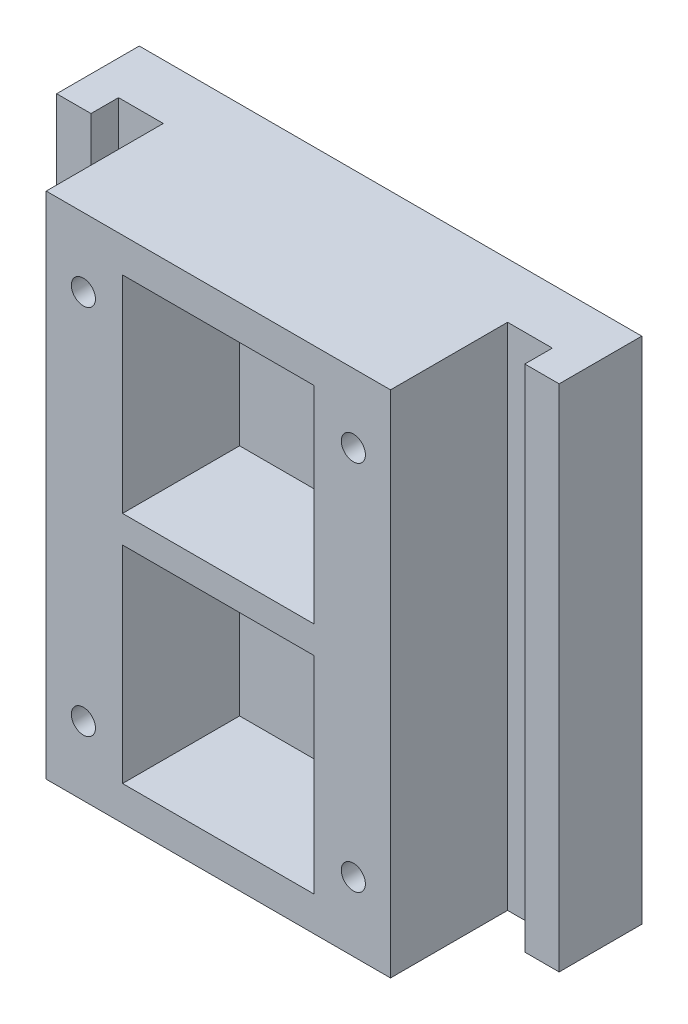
ISO-10303-21;
HEADER;
FILE_DESCRIPTION(('STEP AP214'),'2;1');
FILE_NAME('part.step','',(''),(''),'','','');
FILE_SCHEMA(('AUTOMOTIVE_DESIGN { 1 0 10303 214 1 1 1 1 }'));
ENDSEC;
DATA;
#1=APPLICATION_CONTEXT('core data for automotive mechanical design processes');
#2=APPLICATION_PROTOCOL_DEFINITION('international standard','automotive_design',2000,#1);
#3=PRODUCT_CONTEXT('',#1,'mechanical');
#4=PRODUCT('Part','Part','',(#3));
#5=PRODUCT_RELATED_PRODUCT_CATEGORY('part','',(#4));
#6=PRODUCT_DEFINITION_FORMATION('','',#4);
#7=PRODUCT_DEFINITION_CONTEXT('part definition',#1,'design');
#8=PRODUCT_DEFINITION('design','',#6,#7);
#9=PRODUCT_DEFINITION_SHAPE('','',#8);
#10=(LENGTH_UNIT() NAMED_UNIT(*) SI_UNIT(.MILLI.,.METRE.));
#11=(NAMED_UNIT(*) PLANE_ANGLE_UNIT() SI_UNIT($,.RADIAN.));
#12=(NAMED_UNIT(*) SI_UNIT($,.STERADIAN.) SOLID_ANGLE_UNIT());
#13=UNCERTAINTY_MEASURE_WITH_UNIT(LENGTH_MEASURE(1.E-05),#10,'distance_accuracy_value','');
#14=(GEOMETRIC_REPRESENTATION_CONTEXT(3) GLOBAL_UNCERTAINTY_ASSIGNED_CONTEXT((#13)) GLOBAL_UNIT_ASSIGNED_CONTEXT((#10,
#11,#12)) REPRESENTATION_CONTEXT('',''));
#15=CARTESIAN_POINT('',(0.,0.,0.));
#16=DIRECTION('',(0.,0.,1.));
#17=DIRECTION('',(1.,0.,0.));
#18=AXIS2_PLACEMENT_3D('',#15,#16,#17);
#19=CARTESIAN_POINT('',(0.,0.,8.));
#20=DIRECTION('',(0.,0.,1.));
#21=DIRECTION('',(1.,0.,0.));
#22=AXIS2_PLACEMENT_3D('',#19,#20,#21);
#23=PLANE('',#22);
#24=DIRECTION('',(0.,1.,0.));
#25=VECTOR('',#24,1.);
#26=CARTESIAN_POINT('',(88.5703211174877,0.,8.));
#27=LINE('',#26,#25);
#28=CARTESIAN_POINT('',(88.5703211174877,5.00000000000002,8.));
#29=VERTEX_POINT('',#28);
#30=CARTESIAN_POINT('',(88.5703211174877,35.,8.));
#31=VERTEX_POINT('',#30);
#32=EDGE_CURVE('E323',#29,#31,#27,.T.);
#33=ORIENTED_EDGE('',*,*,#32,.T.);
#34=DIRECTION('',(1.,0.,0.));
#35=VECTOR('',#34,1.);
#36=CARTESIAN_POINT('',(60.7296788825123,35.,8.));
#37=LINE('',#36,#35);
#38=CARTESIAN_POINT('',(60.7296788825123,35.,8.));
#39=VERTEX_POINT('',#38);
#40=EDGE_CURVE('E204',#39,#31,#37,.T.);
#41=ORIENTED_EDGE('',*,*,#40,.F.);
#42=DIRECTION('',(0.,1.,0.));
#43=VECTOR('',#42,1.);
#44=CARTESIAN_POINT('',(60.7296788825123,0.,8.));
#45=LINE('',#44,#43);
#46=CARTESIAN_POINT('',(60.7296788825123,5.00000000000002,8.));
#47=VERTEX_POINT('',#46);
#48=EDGE_CURVE('E193',#47,#39,#45,.T.);
#49=ORIENTED_EDGE('',*,*,#48,.F.);
#50=DIRECTION('',(-1.,0.,0.));
#51=VECTOR('',#50,1.);
#52=CARTESIAN_POINT('',(0.,5.00000000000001,8.));
#53=LINE('',#52,#51);
#54=EDGE_CURVE('E320',#29,#47,#53,.T.);
#55=ORIENTED_EDGE('',*,*,#54,.F.);
#56=EDGE_LOOP('',(#33,#41,#49,#55));
#57=FACE_BOUND('',#56,.T.);
#58=ADVANCED_FACE('F33',(#57),#23,.T.);
#59=CARTESIAN_POINT('',(60.7296788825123,38.97,8.));
#60=VERTEX_POINT('',#59);
#61=CARTESIAN_POINT('',(60.7296788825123,68.97,8.));
#62=VERTEX_POINT('',#61);
#63=EDGE_CURVE('E318',#60,#62,#45,.T.);
#64=ORIENTED_EDGE('',*,*,#63,.F.);
#65=DIRECTION('',(-1.,0.,0.));
#66=VECTOR('',#65,1.);
#67=CARTESIAN_POINT('',(60.7296788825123,38.97,8.));
#68=LINE('',#67,#66);
#69=CARTESIAN_POINT('',(88.5703211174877,38.97,8.));
#70=VERTEX_POINT('',#69);
#71=EDGE_CURVE('E50',#70,#60,#68,.T.);
#72=ORIENTED_EDGE('',*,*,#71,.F.);
#73=CARTESIAN_POINT('',(88.5703211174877,68.97,8.));
#74=VERTEX_POINT('',#73);
#75=EDGE_CURVE('E322',#70,#74,#27,.T.);
#76=ORIENTED_EDGE('',*,*,#75,.T.);
#77=DIRECTION('',(-1.,0.,0.));
#78=VECTOR('',#77,1.);
#79=CARTESIAN_POINT('',(0.,68.97,8.));
#80=LINE('',#79,#78);
#81=EDGE_CURVE('E325',#74,#62,#80,.T.);
#82=ORIENTED_EDGE('',*,*,#81,.T.);
#83=EDGE_LOOP('',(#64,#72,#76,#82));
#84=FACE_BOUND('',#83,.T.);
#85=ADVANCED_FACE('F452',(#84),#23,.T.);
#86=CARTESIAN_POINT('',(88.5703211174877,0.,8.));
#87=DIRECTION('',(1.,0.,0.));
#88=DIRECTION('',(0.,0.,-1.));
#89=AXIS2_PLACEMENT_3D('',#86,#87,#88);
#90=PLANE('',#89);
#91=DIRECTION('',(0.,0.,-1.));
#92=VECTOR('',#91,1.);
#93=CARTESIAN_POINT('',(88.5703211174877,35.,25.));
#94=LINE('',#93,#92);
#95=CARTESIAN_POINT('',(88.5703211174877,35.,25.));
#96=VERTEX_POINT('',#95);
#97=EDGE_CURVE('E58',#96,#31,#94,.T.);
#98=ORIENTED_EDGE('',*,*,#97,.T.);
#99=ORIENTED_EDGE('',*,*,#32,.F.);
#100=DIRECTION('',(0.,0.,1.));
#101=VECTOR('',#100,1.);
#102=CARTESIAN_POINT('',(88.5703211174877,5.00000000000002,8.));
#103=LINE('',#102,#101);
#104=CARTESIAN_POINT('',(88.5703211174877,5.00000000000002,25.));
#105=VERTEX_POINT('',#104);
#106=EDGE_CURVE('E335',#29,#105,#103,.T.);
#107=ORIENTED_EDGE('',*,*,#106,.T.);
#108=DIRECTION('',(0.,1.,0.));
#109=VECTOR('',#108,1.);
#110=CARTESIAN_POINT('',(88.5703211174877,5.00000000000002,25.));
#111=LINE('',#110,#109);
#112=EDGE_CURVE('E252',#105,#96,#111,.T.);
#113=ORIENTED_EDGE('',*,*,#112,.T.);
#114=EDGE_LOOP('',(#98,#99,#107,#113));
#115=FACE_BOUND('',#114,.T.);
#116=ADVANCED_FACE('F458',(#115),#90,.F.);
#117=DIRECTION('',(0.,0.,-1.));
#118=VECTOR('',#117,1.);
#119=CARTESIAN_POINT('',(88.5703211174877,38.97,25.));
#120=LINE('',#119,#118);
#121=CARTESIAN_POINT('',(88.5703211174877,38.97,25.));
#122=VERTEX_POINT('',#121);
#123=EDGE_CURVE('E209',#122,#70,#120,.T.);
#124=ORIENTED_EDGE('',*,*,#123,.F.);
#125=CARTESIAN_POINT('',(88.5703211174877,68.97,25.));
#126=VERTEX_POINT('',#125);
#127=EDGE_CURVE('E249',#122,#126,#111,.T.);
#128=ORIENTED_EDGE('',*,*,#127,.T.);
#129=DIRECTION('',(0.,0.,1.));
#130=VECTOR('',#129,1.);
#131=CARTESIAN_POINT('',(88.5703211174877,68.97,8.));
#132=LINE('',#131,#130);
#133=EDGE_CURVE('E332',#74,#126,#132,.T.);
#134=ORIENTED_EDGE('',*,*,#133,.F.);
#135=ORIENTED_EDGE('',*,*,#75,.F.);
#136=EDGE_LOOP('',(#124,#128,#134,#135));
#137=FACE_BOUND('',#136,.T.);
#138=ADVANCED_FACE('F470',(#137),#90,.F.);
#139=CARTESIAN_POINT('',(60.7296788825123,0.,8.));
#140=DIRECTION('',(1.,0.,0.));
#141=DIRECTION('',(0.,0.,-1.));
#142=AXIS2_PLACEMENT_3D('',#139,#140,#141);
#143=PLANE('',#142);
#144=ORIENTED_EDGE('',*,*,#48,.T.);
#145=DIRECTION('',(0.,0.,-1.));
#146=VECTOR('',#145,1.);
#147=CARTESIAN_POINT('',(60.7296788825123,35.,25.));
#148=LINE('',#147,#146);
#149=CARTESIAN_POINT('',(60.7296788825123,35.,25.));
#150=VERTEX_POINT('',#149);
#151=EDGE_CURVE('E190',#150,#39,#148,.T.);
#152=ORIENTED_EDGE('',*,*,#151,.F.);
#153=DIRECTION('',(0.,-1.,0.));
#154=VECTOR('',#153,1.);
#155=CARTESIAN_POINT('',(60.7296788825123,5.00000000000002,25.));
#156=LINE('',#155,#154);
#157=CARTESIAN_POINT('',(60.7296788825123,5.00000000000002,25.));
#158=VERTEX_POINT('',#157);
#159=EDGE_CURVE('E173',#150,#158,#156,.T.);
#160=ORIENTED_EDGE('',*,*,#159,.T.);
#161=DIRECTION('',(0.,0.,1.));
#162=VECTOR('',#161,1.);
#163=CARTESIAN_POINT('',(60.7296788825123,5.00000000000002,8.));
#164=LINE('',#163,#162);
#165=EDGE_CURVE('E328',#47,#158,#164,.T.);
#166=ORIENTED_EDGE('',*,*,#165,.F.);
#167=EDGE_LOOP('',(#144,#152,#160,#166));
#168=FACE_BOUND('',#167,.T.);
#169=ADVANCED_FACE('F191',(#168),#143,.T.);
#170=CARTESIAN_POINT('',(60.7296788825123,68.97,25.));
#171=VERTEX_POINT('',#170);
#172=CARTESIAN_POINT('',(60.7296788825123,38.97,25.));
#173=VERTEX_POINT('',#172);
#174=EDGE_CURVE('E185',#171,#173,#156,.T.);
#175=ORIENTED_EDGE('',*,*,#174,.T.);
#176=DIRECTION('',(0.,0.,-1.));
#177=VECTOR('',#176,1.);
#178=CARTESIAN_POINT('',(60.7296788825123,38.97,25.));
#179=LINE('',#178,#177);
#180=EDGE_CURVE('E202',#173,#60,#179,.T.);
#181=ORIENTED_EDGE('',*,*,#180,.T.);
#182=ORIENTED_EDGE('',*,*,#63,.T.);
#183=DIRECTION('',(0.,0.,1.));
#184=VECTOR('',#183,1.);
#185=CARTESIAN_POINT('',(60.7296788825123,68.97,8.));
#186=LINE('',#185,#184);
#187=EDGE_CURVE('E329',#62,#171,#186,.T.);
#188=ORIENTED_EDGE('',*,*,#187,.T.);
#189=EDGE_LOOP('',(#175,#181,#182,#188));
#190=FACE_BOUND('',#189,.T.);
#191=ADVANCED_FACE('F382',(#190),#143,.T.);
#192=CARTESIAN_POINT('',(0.,0.,25.));
#193=DIRECTION('',(0.,0.,1.));
#194=DIRECTION('',(1.,0.,0.));
#195=AXIS2_PLACEMENT_3D('',#192,#193,#194);
#196=PLANE('',#195);
#197=ORIENTED_EDGE('',*,*,#127,.F.);
#198=DIRECTION('',(-1.,0.,0.));
#199=VECTOR('',#198,1.);
#200=CARTESIAN_POINT('',(60.7296788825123,38.97,25.));
#201=LINE('',#200,#199);
#202=EDGE_CURVE('E199',#122,#173,#201,.T.);
#203=ORIENTED_EDGE('',*,*,#202,.T.);
#204=ORIENTED_EDGE('',*,*,#174,.F.);
#205=DIRECTION('',(-1.,0.,0.));
#206=VECTOR('',#205,1.);
#207=CARTESIAN_POINT('',(88.5703211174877,68.97,25.));
#208=LINE('',#207,#206);
#209=EDGE_CURVE('E186',#126,#171,#208,.T.);
#210=ORIENTED_EDGE('',*,*,#209,.F.);
#211=EDGE_LOOP('',(#197,#203,#204,#210));
#212=FACE_BOUND('',#211,.T.);
#213=CARTESIAN_POINT('',(55.0489275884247,10.,25.));
#214=DIRECTION('',(0.,0.,-1.));
#215=DIRECTION('',(-1.,0.,0.));
#216=AXIS2_PLACEMENT_3D('',#213,#214,#215);
#217=CIRCLE('',#216,1.75);
#218=CARTESIAN_POINT('',(53.2989275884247,10.,25.));
#219=VERTEX_POINT('',#218);
#220=EDGE_CURVE('E215',#219,#219,#217,.T.);
#221=ORIENTED_EDGE('',*,*,#220,.T.);
#222=EDGE_LOOP('',(#221));
#223=FACE_BOUND('',#222,.T.);
#224=CARTESIAN_POINT('',(94.2510724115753,63.97,25.));
#225=DIRECTION('',(0.,0.,1.));
#226=DIRECTION('',(1.,0.,0.));
#227=AXIS2_PLACEMENT_3D('',#224,#225,#226);
#228=CIRCLE('',#227,1.75);
#229=CARTESIAN_POINT('',(96.0010724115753,63.97,25.));
#230=VERTEX_POINT('',#229);
#231=EDGE_CURVE('E229',#230,#230,#228,.T.);
#232=ORIENTED_EDGE('',*,*,#231,.F.);
#233=EDGE_LOOP('',(#232));
#234=FACE_BOUND('',#233,.T.);
#235=CARTESIAN_POINT('',(94.2510724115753,10.,25.));
#236=DIRECTION('',(0.,0.,1.));
#237=DIRECTION('',(1.,0.,0.));
#238=AXIS2_PLACEMENT_3D('',#235,#236,#237);
#239=CIRCLE('',#238,1.75);
#240=CARTESIAN_POINT('',(96.0010724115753,10.,25.));
#241=VERTEX_POINT('',#240);
#242=EDGE_CURVE('E235',#241,#241,#239,.T.);
#243=ORIENTED_EDGE('',*,*,#242,.F.);
#244=EDGE_LOOP('',(#243));
#245=FACE_BOUND('',#244,.T.);
#246=DIRECTION('',(0.,1.,0.));
#247=VECTOR('',#246,1.);
#248=CARTESIAN_POINT('',(99.65,0.,25.));
#249=LINE('',#248,#247);
#250=CARTESIAN_POINT('',(99.65,0.,25.));
#251=VERTEX_POINT('',#250);
#252=CARTESIAN_POINT('',(99.65,73.97,25.));
#253=VERTEX_POINT('',#252);
#254=EDGE_CURVE('E257',#251,#253,#249,.T.);
#255=ORIENTED_EDGE('',*,*,#254,.T.);
#256=DIRECTION('',(-1.,0.,0.));
#257=VECTOR('',#256,1.);
#258=CARTESIAN_POINT('',(99.65,73.97,25.));
#259=LINE('',#258,#257);
#260=CARTESIAN_POINT('',(49.65,73.97,25.));
#261=VERTEX_POINT('',#260);
#262=EDGE_CURVE('E260',#253,#261,#259,.T.);
#263=ORIENTED_EDGE('',*,*,#262,.T.);
#264=DIRECTION('',(0.,-1.,0.));
#265=VECTOR('',#264,1.);
#266=CARTESIAN_POINT('',(49.65,0.,25.));
#267=LINE('',#266,#265);
#268=CARTESIAN_POINT('',(49.65,0.,25.));
#269=VERTEX_POINT('',#268);
#270=EDGE_CURVE('E263',#261,#269,#267,.T.);
#271=ORIENTED_EDGE('',*,*,#270,.T.);
#272=DIRECTION('',(1.,0.,0.));
#273=VECTOR('',#272,1.);
#274=CARTESIAN_POINT('',(99.65,0.,25.));
#275=LINE('',#274,#273);
#276=EDGE_CURVE('E266',#269,#251,#275,.T.);
#277=ORIENTED_EDGE('',*,*,#276,.T.);
#278=EDGE_LOOP('',(#255,#263,#271,#277));
#279=FACE_BOUND('',#278,.T.);
#280=DIRECTION('',(1.,0.,0.));
#281=VECTOR('',#280,1.);
#282=CARTESIAN_POINT('',(60.7296788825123,35.,25.));
#283=LINE('',#282,#281);
#284=EDGE_CURVE('E179',#150,#96,#283,.T.);
#285=ORIENTED_EDGE('',*,*,#284,.T.);
#286=ORIENTED_EDGE('',*,*,#112,.F.);
#287=DIRECTION('',(1.,0.,0.));
#288=VECTOR('',#287,1.);
#289=CARTESIAN_POINT('',(88.5703211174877,5.00000000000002,25.));
#290=LINE('',#289,#288);
#291=EDGE_CURVE('E181',#158,#105,#290,.T.);
#292=ORIENTED_EDGE('',*,*,#291,.F.);
#293=ORIENTED_EDGE('',*,*,#159,.F.);
#294=EDGE_LOOP('',(#285,#286,#292,#293));
#295=FACE_BOUND('',#294,.T.);
#296=CARTESIAN_POINT('',(55.0489275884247,63.97,25.));
#297=DIRECTION('',(0.,0.,-1.));
#298=DIRECTION('',(-1.,0.,0.));
#299=AXIS2_PLACEMENT_3D('',#296,#297,#298);
#300=CIRCLE('',#299,1.75);
#301=CARTESIAN_POINT('',(53.2989275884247,63.97,25.));
#302=VERTEX_POINT('',#301);
#303=EDGE_CURVE('E196',#302,#302,#300,.T.);
#304=ORIENTED_EDGE('',*,*,#303,.T.);
#305=EDGE_LOOP('',(#304));
#306=FACE_BOUND('',#305,.T.);
#307=ADVANCED_FACE('F175',(#212,#223,#234,#245,#279,#295,#306),#196,.T.);
#308=CARTESIAN_POINT('',(55.0489275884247,63.97,15.));
#309=DIRECTION('',(0.,0.,-1.));
#310=DIRECTION('',(-1.,0.,0.));
#311=AXIS2_PLACEMENT_3D('',#308,#309,#310);
#312=PLANE('',#311);
#313=CARTESIAN_POINT('',(55.0489275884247,63.97,15.));
#314=DIRECTION('',(0.,0.,-1.));
#315=DIRECTION('',(-1.,0.,0.));
#316=AXIS2_PLACEMENT_3D('',#313,#314,#315);
#317=CIRCLE('',#316,3.00000000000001);
#318=CARTESIAN_POINT('',(52.0489275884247,63.97,15.));
#319=VERTEX_POINT('',#318);
#320=EDGE_CURVE('E226',#319,#319,#317,.T.);
#321=ORIENTED_EDGE('',*,*,#320,.T.);
#322=EDGE_LOOP('',(#321));
#323=FACE_BOUND('',#322,.T.);
#324=CARTESIAN_POINT('',(55.0489275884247,63.97,15.));
#325=DIRECTION('',(0.,0.,-1.));
#326=DIRECTION('',(-1.,0.,0.));
#327=AXIS2_PLACEMENT_3D('',#324,#325,#326);
#328=CIRCLE('',#327,1.75);
#329=CARTESIAN_POINT('',(53.2989275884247,63.97,15.));
#330=VERTEX_POINT('',#329);
#331=EDGE_CURVE('E37',#330,#330,#328,.F.);
#332=ORIENTED_EDGE('',*,*,#331,.T.);
#333=EDGE_LOOP('',(#332));
#334=FACE_BOUND('',#333,.T.);
#335=ADVANCED_FACE('F381',(#323,#334),#312,.T.);
#336=CARTESIAN_POINT('',(55.0489275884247,10.,15.));
#337=DIRECTION('',(0.,0.,-1.));
#338=DIRECTION('',(-1.,0.,0.));
#339=AXIS2_PLACEMENT_3D('',#336,#337,#338);
#340=PLANE('',#339);
#341=CARTESIAN_POINT('',(55.0489275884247,10.,15.));
#342=DIRECTION('',(0.,0.,-1.));
#343=DIRECTION('',(-1.,0.,0.));
#344=AXIS2_PLACEMENT_3D('',#341,#342,#343);
#345=CIRCLE('',#344,3.00000000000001);
#346=CARTESIAN_POINT('',(52.0489275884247,10.,15.));
#347=VERTEX_POINT('',#346);
#348=EDGE_CURVE('E219',#347,#347,#345,.T.);
#349=ORIENTED_EDGE('',*,*,#348,.T.);
#350=EDGE_LOOP('',(#349));
#351=FACE_BOUND('',#350,.T.);
#352=CARTESIAN_POINT('',(55.0489275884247,10.,15.));
#353=DIRECTION('',(0.,0.,-1.));
#354=DIRECTION('',(-1.,0.,0.));
#355=AXIS2_PLACEMENT_3D('',#352,#353,#354);
#356=CIRCLE('',#355,1.75);
#357=CARTESIAN_POINT('',(53.2989275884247,10.,15.));
#358=VERTEX_POINT('',#357);
#359=EDGE_CURVE('E218',#358,#358,#356,.F.);
#360=ORIENTED_EDGE('',*,*,#359,.T.);
#361=EDGE_LOOP('',(#360));
#362=FACE_BOUND('',#361,.T.);
#363=ADVANCED_FACE('F369',(#351,#362),#340,.T.);
#364=CARTESIAN_POINT('',(0.,0.,12.));
#365=DIRECTION('',(0.,0.,-1.));
#366=DIRECTION('',(-1.,0.,0.));
#367=AXIS2_PLACEMENT_3D('',#364,#365,#366);
#368=PLANE('',#367);
#369=DIRECTION('',(0.,-1.,0.));
#370=VECTOR('',#369,1.);
#371=CARTESIAN_POINT('',(43.15,0.,12.));
#372=LINE('',#371,#370);
#373=CARTESIAN_POINT('',(43.15,73.97,12.));
#374=VERTEX_POINT('',#373);
#375=CARTESIAN_POINT('',(43.15,0.,12.));
#376=VERTEX_POINT('',#375);
#377=EDGE_CURVE('E342',#374,#376,#372,.T.);
#378=ORIENTED_EDGE('',*,*,#377,.F.);
#379=DIRECTION('',(-1.,0.,0.));
#380=VECTOR('',#379,1.);
#381=CARTESIAN_POINT('',(0.,73.97,12.));
#382=LINE('',#381,#380);
#383=CARTESIAN_POINT('',(38.1622400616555,73.97,12.));
#384=VERTEX_POINT('',#383);
#385=EDGE_CURVE('E353',#374,#384,#382,.T.);
#386=ORIENTED_EDGE('',*,*,#385,.T.);
#387=DIRECTION('',(0.,1.,0.));
#388=VECTOR('',#387,1.);
#389=CARTESIAN_POINT('',(38.1622400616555,0.,12.));
#390=LINE('',#389,#388);
#391=CARTESIAN_POINT('',(38.1622400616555,0.,12.));
#392=VERTEX_POINT('',#391);
#393=EDGE_CURVE('E310',#392,#384,#390,.T.);
#394=ORIENTED_EDGE('',*,*,#393,.F.);
#395=DIRECTION('',(1.,0.,0.));
#396=VECTOR('',#395,1.);
#397=CARTESIAN_POINT('',(0.,0.,12.));
#398=LINE('',#397,#396);
#399=EDGE_CURVE('E350',#392,#376,#398,.T.);
#400=ORIENTED_EDGE('',*,*,#399,.T.);
#401=EDGE_LOOP('',(#378,#386,#394,#400));
#402=FACE_BOUND('',#401,.T.);
#403=ADVANCED_FACE('F435',(#402),#368,.F.);
#404=CARTESIAN_POINT('',(111.137759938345,73.97,12.));
#405=VERTEX_POINT('',#404);
#406=CARTESIAN_POINT('',(106.15,73.97,12.));
#407=VERTEX_POINT('',#406);
#408=EDGE_CURVE('E355',#405,#407,#382,.T.);
#409=ORIENTED_EDGE('',*,*,#408,.T.);
#410=DIRECTION('',(0.,-1.,0.));
#411=VECTOR('',#410,1.);
#412=CARTESIAN_POINT('',(106.15,0.,12.));
#413=LINE('',#412,#411);
#414=CARTESIAN_POINT('',(106.15,0.,12.));
#415=VERTEX_POINT('',#414);
#416=EDGE_CURVE('E331',#407,#415,#413,.T.);
#417=ORIENTED_EDGE('',*,*,#416,.T.);
#418=CARTESIAN_POINT('',(111.137759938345,0.,12.));
#419=VERTEX_POINT('',#418);
#420=EDGE_CURVE('E354',#415,#419,#398,.T.);
#421=ORIENTED_EDGE('',*,*,#420,.T.);
#422=DIRECTION('',(0.,-1.,0.));
#423=VECTOR('',#422,1.);
#424=CARTESIAN_POINT('',(111.137759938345,0.,12.));
#425=LINE('',#424,#423);
#426=EDGE_CURVE('E300',#405,#419,#425,.T.);
#427=ORIENTED_EDGE('',*,*,#426,.F.);
#428=EDGE_LOOP('',(#409,#417,#421,#427));
#429=FACE_BOUND('',#428,.T.);
#430=ADVANCED_FACE('F418',(#429),#368,.F.);
#431=CARTESIAN_POINT('',(0.,0.,12.));
#432=DIRECTION('',(0.,1.,0.));
#433=DIRECTION('',(0.,0.,1.));
#434=AXIS2_PLACEMENT_3D('',#431,#432,#433);
#435=PLANE('',#434);
#436=DIRECTION('',(0.,0.,1.));
#437=VECTOR('',#436,1.);
#438=CARTESIAN_POINT('',(99.65,0.,8.));
#439=LINE('',#438,#437);
#440=CARTESIAN_POINT('',(99.65,0.,8.));
#441=VERTEX_POINT('',#440);
#442=EDGE_CURVE('E296',#441,#251,#439,.T.);
#443=ORIENTED_EDGE('',*,*,#442,.T.);
#444=ORIENTED_EDGE('',*,*,#276,.F.);
#445=DIRECTION('',(0.,0.,1.));
#446=VECTOR('',#445,1.);
#447=CARTESIAN_POINT('',(49.65,0.,8.));
#448=LINE('',#447,#446);
#449=CARTESIAN_POINT('',(49.65,0.,8.));
#450=VERTEX_POINT('',#449);
#451=EDGE_CURVE('E289',#450,#269,#448,.T.);
#452=ORIENTED_EDGE('',*,*,#451,.F.);
#453=DIRECTION('',(1.,0.,0.));
#454=VECTOR('',#453,1.);
#455=CARTESIAN_POINT('',(49.65,0.,8.));
#456=LINE('',#455,#454);
#457=CARTESIAN_POINT('',(43.15,0.,8.));
#458=VERTEX_POINT('',#457);
#459=EDGE_CURVE('E284',#458,#450,#456,.T.);
#460=ORIENTED_EDGE('',*,*,#459,.F.);
#461=DIRECTION('',(0.,0.,1.));
#462=VECTOR('',#461,1.);
#463=CARTESIAN_POINT('',(43.15,0.,8.));
#464=LINE('',#463,#462);
#465=EDGE_CURVE('E288',#458,#376,#464,.T.);
#466=ORIENTED_EDGE('',*,*,#465,.T.);
#467=ORIENTED_EDGE('',*,*,#399,.F.);
#468=DIRECTION('',(0.,0.,1.));
#469=VECTOR('',#468,1.);
#470=CARTESIAN_POINT('',(38.1622400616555,0.,-8.));
#471=LINE('',#470,#469);
#472=CARTESIAN_POINT('',(38.1622400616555,0.,0.));
#473=VERTEX_POINT('',#472);
#474=EDGE_CURVE('E313',#473,#392,#471,.T.);
#475=ORIENTED_EDGE('',*,*,#474,.F.);
#476=DIRECTION('',(1.,0.,0.));
#477=VECTOR('',#476,1.);
#478=CARTESIAN_POINT('',(0.,0.,0.));
#479=LINE('',#478,#477);
#480=CARTESIAN_POINT('',(111.137759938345,0.,0.));
#481=VERTEX_POINT('',#480);
#482=EDGE_CURVE('E348',#473,#481,#479,.T.);
#483=ORIENTED_EDGE('',*,*,#482,.T.);
#484=DIRECTION('',(0.,0.,1.));
#485=VECTOR('',#484,1.);
#486=CARTESIAN_POINT('',(111.137759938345,0.,-8.));
#487=LINE('',#486,#485);
#488=EDGE_CURVE('E304',#481,#419,#487,.T.);
#489=ORIENTED_EDGE('',*,*,#488,.T.);
#490=ORIENTED_EDGE('',*,*,#420,.F.);
#491=DIRECTION('',(0.,0.,1.));
#492=VECTOR('',#491,1.);
#493=CARTESIAN_POINT('',(106.15,0.,8.));
#494=LINE('',#493,#492);
#495=CARTESIAN_POINT('',(106.15,0.,8.));
#496=VERTEX_POINT('',#495);
#497=EDGE_CURVE('E297',#496,#415,#494,.T.);
#498=ORIENTED_EDGE('',*,*,#497,.F.);
#499=DIRECTION('',(1.,0.,0.));
#500=VECTOR('',#499,1.);
#501=CARTESIAN_POINT('',(106.15,0.,8.));
#502=LINE('',#501,#500);
#503=EDGE_CURVE('E291',#441,#496,#502,.T.);
#504=ORIENTED_EDGE('',*,*,#503,.F.);
#505=EDGE_LOOP('',(#443,#444,#452,#460,#466,#467,#475,#483,#489,#490,#498,#504));
#506=FACE_BOUND('',#505,.T.);
#507=ADVANCED_FACE('F35',(#506),#435,.F.);
#508=CARTESIAN_POINT('',(0.,73.97,12.));
#509=DIRECTION('',(0.,-1.,0.));
#510=DIRECTION('',(0.,0.,-1.));
#511=AXIS2_PLACEMENT_3D('',#508,#509,#510);
#512=PLANE('',#511);
#513=DIRECTION('',(0.,0.,1.));
#514=VECTOR('',#513,1.);
#515=CARTESIAN_POINT('',(49.65,73.97,8.));
#516=LINE('',#515,#514);
#517=CARTESIAN_POINT('',(49.65,73.97,8.));
#518=VERTEX_POINT('',#517);
#519=EDGE_CURVE('E280',#518,#261,#516,.T.);
#520=ORIENTED_EDGE('',*,*,#519,.T.);
#521=ORIENTED_EDGE('',*,*,#262,.F.);
#522=DIRECTION('',(0.,0.,1.));
#523=VECTOR('',#522,1.);
#524=CARTESIAN_POINT('',(99.65,73.97,8.));
#525=LINE('',#524,#523);
#526=CARTESIAN_POINT('',(99.65,73.97,8.));
#527=VERTEX_POINT('',#526);
#528=EDGE_CURVE('E273',#527,#253,#525,.T.);
#529=ORIENTED_EDGE('',*,*,#528,.F.);
#530=DIRECTION('',(-1.,0.,0.));
#531=VECTOR('',#530,1.);
#532=CARTESIAN_POINT('',(99.65,73.97,8.));
#533=LINE('',#532,#531);
#534=CARTESIAN_POINT('',(106.15,73.97,8.));
#535=VERTEX_POINT('',#534);
#536=EDGE_CURVE('E269',#535,#527,#533,.T.);
#537=ORIENTED_EDGE('',*,*,#536,.F.);
#538=DIRECTION('',(0.,0.,1.));
#539=VECTOR('',#538,1.);
#540=CARTESIAN_POINT('',(106.15,73.97,8.));
#541=LINE('',#540,#539);
#542=EDGE_CURVE('E272',#535,#407,#541,.T.);
#543=ORIENTED_EDGE('',*,*,#542,.T.);
#544=ORIENTED_EDGE('',*,*,#408,.F.);
#545=DIRECTION('',(0.,0.,-1.));
#546=VECTOR('',#545,1.);
#547=CARTESIAN_POINT('',(111.137759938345,73.97,12.));
#548=LINE('',#547,#546);
#549=CARTESIAN_POINT('',(111.137759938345,73.97,0.));
#550=VERTEX_POINT('',#549);
#551=EDGE_CURVE('E307',#405,#550,#548,.T.);
#552=ORIENTED_EDGE('',*,*,#551,.T.);
#553=DIRECTION('',(-1.,0.,0.));
#554=VECTOR('',#553,1.);
#555=CARTESIAN_POINT('',(0.,73.97,0.));
#556=LINE('',#555,#554);
#557=CARTESIAN_POINT('',(38.1622400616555,73.97,0.));
#558=VERTEX_POINT('',#557);
#559=EDGE_CURVE('E360',#550,#558,#556,.T.);
#560=ORIENTED_EDGE('',*,*,#559,.T.);
#561=DIRECTION('',(0.,0.,1.));
#562=VECTOR('',#561,1.);
#563=CARTESIAN_POINT('',(38.1622400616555,73.97,12.));
#564=LINE('',#563,#562);
#565=EDGE_CURVE('E315',#558,#384,#564,.T.);
#566=ORIENTED_EDGE('',*,*,#565,.T.);
#567=ORIENTED_EDGE('',*,*,#385,.F.);
#568=DIRECTION('',(0.,0.,1.));
#569=VECTOR('',#568,1.);
#570=CARTESIAN_POINT('',(43.15,73.97,8.));
#571=LINE('',#570,#569);
#572=CARTESIAN_POINT('',(43.15,73.97,8.));
#573=VERTEX_POINT('',#572);
#574=EDGE_CURVE('E281',#573,#374,#571,.T.);
#575=ORIENTED_EDGE('',*,*,#574,.F.);
#576=DIRECTION('',(-1.,0.,0.));
#577=VECTOR('',#576,1.);
#578=CARTESIAN_POINT('',(43.15,73.97,8.));
#579=LINE('',#578,#577);
#580=EDGE_CURVE('E275',#518,#573,#579,.T.);
#581=ORIENTED_EDGE('',*,*,#580,.F.);
#582=EDGE_LOOP('',(#520,#521,#529,#537,#543,#544,#552,#560,#566,#567,#575,#581));
#583=FACE_BOUND('',#582,.T.);
#584=ADVANCED_FACE('F400',(#583),#512,.F.);
#585=CARTESIAN_POINT('',(0.,0.,0.));
#586=DIRECTION('',(0.,0.,-1.));
#587=DIRECTION('',(-1.,0.,0.));
#588=AXIS2_PLACEMENT_3D('',#585,#586,#587);
#589=PLANE('',#588);
#590=CARTESIAN_POINT('',(55.0489275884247,10.,0.));
#591=DIRECTION('',(0.,0.,-1.));
#592=DIRECTION('',(-1.,0.,0.));
#593=AXIS2_PLACEMENT_3D('',#590,#591,#592);
#594=CIRCLE('',#593,3.00000000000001);
#595=CARTESIAN_POINT('',(52.0489275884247,10.,0.));
#596=VERTEX_POINT('',#595);
#597=EDGE_CURVE('E223',#596,#596,#594,.T.);
#598=ORIENTED_EDGE('',*,*,#597,.F.);
#599=EDGE_LOOP('',(#598));
#600=FACE_BOUND('',#599,.T.);
#601=CARTESIAN_POINT('',(55.0489275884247,63.97,0.));
#602=DIRECTION('',(0.,0.,-1.));
#603=DIRECTION('',(-1.,0.,0.));
#604=AXIS2_PLACEMENT_3D('',#601,#602,#603);
#605=CIRCLE('',#604,3.00000000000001);
#606=CARTESIAN_POINT('',(52.0489275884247,63.97,0.));
#607=VERTEX_POINT('',#606);
#608=EDGE_CURVE('E222',#607,#607,#605,.T.);
#609=ORIENTED_EDGE('',*,*,#608,.F.);
#610=EDGE_LOOP('',(#609));
#611=FACE_BOUND('',#610,.T.);
#612=CARTESIAN_POINT('',(94.2510724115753,10.,0.));
#613=DIRECTION('',(0.,0.,-1.));
#614=DIRECTION('',(-1.,0.,0.));
#615=AXIS2_PLACEMENT_3D('',#612,#613,#614);
#616=CIRCLE('',#615,3.00000000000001);
#617=CARTESIAN_POINT('',(91.2510724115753,10.,0.));
#618=VERTEX_POINT('',#617);
#619=EDGE_CURVE('E243',#618,#618,#616,.T.);
#620=ORIENTED_EDGE('',*,*,#619,.F.);
#621=EDGE_LOOP('',(#620));
#622=FACE_BOUND('',#621,.T.);
#623=CARTESIAN_POINT('',(94.2510724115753,63.97,0.));
#624=DIRECTION('',(0.,0.,-1.));
#625=DIRECTION('',(-1.,0.,0.));
#626=AXIS2_PLACEMENT_3D('',#623,#624,#625);
#627=CIRCLE('',#626,3.00000000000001);
#628=CARTESIAN_POINT('',(91.2510724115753,63.97,0.));
#629=VERTEX_POINT('',#628);
#630=EDGE_CURVE('E242',#629,#629,#627,.T.);
#631=ORIENTED_EDGE('',*,*,#630,.F.);
#632=EDGE_LOOP('',(#631));
#633=FACE_BOUND('',#632,.T.);
#634=DIRECTION('',(0.,1.,0.));
#635=VECTOR('',#634,1.);
#636=CARTESIAN_POINT('',(111.137759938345,0.,0.));
#637=LINE('',#636,#635);
#638=EDGE_CURVE('E11',#481,#550,#637,.T.);
#639=ORIENTED_EDGE('',*,*,#638,.F.);
#640=ORIENTED_EDGE('',*,*,#482,.F.);
#641=DIRECTION('',(0.,-1.,0.));
#642=VECTOR('',#641,1.);
#643=CARTESIAN_POINT('',(38.1622400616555,0.,0.));
#644=LINE('',#643,#642);
#645=EDGE_CURVE('E42',#558,#473,#644,.T.);
#646=ORIENTED_EDGE('',*,*,#645,.F.);
#647=ORIENTED_EDGE('',*,*,#559,.F.);
#648=EDGE_LOOP('',(#639,#640,#646,#647));
#649=FACE_BOUND('',#648,.T.);
#650=ADVANCED_FACE('F427',(#600,#611,#622,#633,#649),#589,.T.);
#651=CARTESIAN_POINT('',(49.65,0.,8.));
#652=DIRECTION('',(-1.,0.,0.));
#653=DIRECTION('',(0.,-1.,0.));
#654=AXIS2_PLACEMENT_3D('',#651,#652,#653);
#655=PLANE('',#654);
#656=ORIENTED_EDGE('',*,*,#451,.T.);
#657=ORIENTED_EDGE('',*,*,#270,.F.);
#658=ORIENTED_EDGE('',*,*,#519,.F.);
#659=DIRECTION('',(0.,-1.,0.));
#660=VECTOR('',#659,1.);
#661=CARTESIAN_POINT('',(49.65,0.,8.));
#662=LINE('',#661,#660);
#663=EDGE_CURVE('E346',#518,#450,#662,.T.);
#664=ORIENTED_EDGE('',*,*,#663,.T.);
#665=EDGE_LOOP('',(#656,#657,#658,#664));
#666=FACE_BOUND('',#665,.T.);
#667=ADVANCED_FACE('F405',(#666),#655,.T.);
#668=CARTESIAN_POINT('',(43.15,0.,8.));
#669=DIRECTION('',(-1.,0.,0.));
#670=DIRECTION('',(0.,-1.,0.));
#671=AXIS2_PLACEMENT_3D('',#668,#669,#670);
#672=PLANE('',#671);
#673=ORIENTED_EDGE('',*,*,#377,.T.);
#674=ORIENTED_EDGE('',*,*,#465,.F.);
#675=DIRECTION('',(0.,-1.,0.));
#676=VECTOR('',#675,1.);
#677=CARTESIAN_POINT('',(43.15,0.,8.));
#678=LINE('',#677,#676);
#679=EDGE_CURVE('E344',#573,#458,#678,.T.);
#680=ORIENTED_EDGE('',*,*,#679,.F.);
#681=ORIENTED_EDGE('',*,*,#574,.T.);
#682=EDGE_LOOP('',(#673,#674,#680,#681));
#683=FACE_BOUND('',#682,.T.);
#684=ADVANCED_FACE('F438',(#683),#672,.F.);
#685=CARTESIAN_POINT('',(0.,0.,8.));
#686=DIRECTION('',(0.,0.,1.));
#687=DIRECTION('',(1.,0.,0.));
#688=AXIS2_PLACEMENT_3D('',#685,#686,#687);
#689=PLANE('',#688);
#690=ORIENTED_EDGE('',*,*,#663,.F.);
#691=ORIENTED_EDGE('',*,*,#580,.T.);
#692=ORIENTED_EDGE('',*,*,#679,.T.);
#693=ORIENTED_EDGE('',*,*,#459,.T.);
#694=EDGE_LOOP('',(#690,#691,#692,#693));
#695=FACE_BOUND('',#694,.T.);
#696=ADVANCED_FACE('F440',(#695),#689,.T.);
#697=CARTESIAN_POINT('',(106.15,0.,8.));
#698=DIRECTION('',(-1.,0.,0.));
#699=DIRECTION('',(0.,0.,1.));
#700=AXIS2_PLACEMENT_3D('',#697,#698,#699);
#701=PLANE('',#700);
#702=ORIENTED_EDGE('',*,*,#416,.F.);
#703=ORIENTED_EDGE('',*,*,#542,.F.);
#704=DIRECTION('',(0.,-1.,0.));
#705=VECTOR('',#704,1.);
#706=CARTESIAN_POINT('',(106.15,0.,8.));
#707=LINE('',#706,#705);
#708=EDGE_CURVE('E338',#535,#496,#707,.T.);
#709=ORIENTED_EDGE('',*,*,#708,.T.);
#710=ORIENTED_EDGE('',*,*,#497,.T.);
#711=EDGE_LOOP('',(#702,#703,#709,#710));
#712=FACE_BOUND('',#711,.T.);
#713=ADVANCED_FACE('F442',(#712),#701,.T.);
#714=CARTESIAN_POINT('',(99.65,0.,8.));
#715=DIRECTION('',(-1.,0.,0.));
#716=DIRECTION('',(0.,-1.,0.));
#717=AXIS2_PLACEMENT_3D('',#714,#715,#716);
#718=PLANE('',#717);
#719=ORIENTED_EDGE('',*,*,#528,.T.);
#720=ORIENTED_EDGE('',*,*,#254,.F.);
#721=ORIENTED_EDGE('',*,*,#442,.F.);
#722=DIRECTION('',(0.,-1.,0.));
#723=VECTOR('',#722,1.);
#724=CARTESIAN_POINT('',(99.65,0.,8.));
#725=LINE('',#724,#723);
#726=EDGE_CURVE('E340',#527,#441,#725,.T.);
#727=ORIENTED_EDGE('',*,*,#726,.F.);
#728=EDGE_LOOP('',(#719,#720,#721,#727));
#729=FACE_BOUND('',#728,.T.);
#730=ADVANCED_FACE('F395',(#729),#718,.F.);
#731=CARTESIAN_POINT('',(0.,0.,8.));
#732=DIRECTION('',(0.,0.,1.));
#733=DIRECTION('',(1.,0.,0.));
#734=AXIS2_PLACEMENT_3D('',#731,#732,#733);
#735=PLANE('',#734);
#736=ORIENTED_EDGE('',*,*,#708,.F.);
#737=ORIENTED_EDGE('',*,*,#536,.T.);
#738=ORIENTED_EDGE('',*,*,#726,.T.);
#739=ORIENTED_EDGE('',*,*,#503,.T.);
#740=EDGE_LOOP('',(#736,#737,#738,#739));
#741=FACE_BOUND('',#740,.T.);
#742=ADVANCED_FACE('F412',(#741),#735,.T.);
#743=CARTESIAN_POINT('',(38.1622400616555,0.,-8.));
#744=DIRECTION('',(1.,0.,0.));
#745=DIRECTION('',(0.,0.,-1.));
#746=AXIS2_PLACEMENT_3D('',#743,#744,#745);
#747=PLANE('',#746);
#748=ORIENTED_EDGE('',*,*,#645,.T.);
#749=ORIENTED_EDGE('',*,*,#474,.T.);
#750=ORIENTED_EDGE('',*,*,#393,.T.);
#751=ORIENTED_EDGE('',*,*,#565,.F.);
#752=EDGE_LOOP('',(#748,#749,#750,#751));
#753=FACE_BOUND('',#752,.T.);
#754=ADVANCED_FACE('F432',(#753),#747,.F.);
#755=CARTESIAN_POINT('',(111.137759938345,0.,-8.));
#756=DIRECTION('',(-1.,0.,0.));
#757=DIRECTION('',(0.,0.,1.));
#758=AXIS2_PLACEMENT_3D('',#755,#756,#757);
#759=PLANE('',#758);
#760=ORIENTED_EDGE('',*,*,#426,.T.);
#761=ORIENTED_EDGE('',*,*,#488,.F.);
#762=ORIENTED_EDGE('',*,*,#638,.T.);
#763=ORIENTED_EDGE('',*,*,#551,.F.);
#764=EDGE_LOOP('',(#760,#761,#762,#763));
#765=FACE_BOUND('',#764,.T.);
#766=ADVANCED_FACE('F420',(#765),#759,.F.);
#767=CARTESIAN_POINT('',(0.,5.00000000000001,8.));
#768=DIRECTION('',(0.,1.,0.));
#769=DIRECTION('',(-1.,0.,0.));
#770=AXIS2_PLACEMENT_3D('',#767,#768,#769);
#771=PLANE('',#770);
#772=ORIENTED_EDGE('',*,*,#165,.T.);
#773=ORIENTED_EDGE('',*,*,#291,.T.);
#774=ORIENTED_EDGE('',*,*,#106,.F.);
#775=ORIENTED_EDGE('',*,*,#54,.T.);
#776=EDGE_LOOP('',(#772,#773,#774,#775));
#777=FACE_BOUND('',#776,.T.);
#778=ADVANCED_FACE('F466',(#777),#771,.T.);
#779=CARTESIAN_POINT('',(0.,68.97,8.));
#780=DIRECTION('',(0.,1.,0.));
#781=DIRECTION('',(0.,0.,1.));
#782=AXIS2_PLACEMENT_3D('',#779,#780,#781);
#783=PLANE('',#782);
#784=ORIENTED_EDGE('',*,*,#133,.T.);
#785=ORIENTED_EDGE('',*,*,#209,.T.);
#786=ORIENTED_EDGE('',*,*,#187,.F.);
#787=ORIENTED_EDGE('',*,*,#81,.F.);
#788=EDGE_LOOP('',(#784,#785,#786,#787));
#789=FACE_BOUND('',#788,.T.);
#790=ADVANCED_FACE('F462',(#789),#783,.F.);
#791=CARTESIAN_POINT('',(94.2510724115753,63.97,15.));
#792=DIRECTION('',(0.,0.,-1.));
#793=DIRECTION('',(-1.,0.,0.));
#794=AXIS2_PLACEMENT_3D('',#791,#792,#793);
#795=CYLINDRICAL_SURFACE('',#794,3.00000000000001);
#796=CARTESIAN_POINT('',(94.2510724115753,63.97,15.));
#797=DIRECTION('',(0.,0.,-1.));
#798=DIRECTION('',(-1.,0.,0.));
#799=AXIS2_PLACEMENT_3D('',#796,#797,#798);
#800=CIRCLE('',#799,3.00000000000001);
#801=CARTESIAN_POINT('',(91.2510724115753,63.97,15.));
#802=VERTEX_POINT('',#801);
#803=EDGE_CURVE('E246',#802,#802,#800,.T.);
#804=ORIENTED_EDGE('',*,*,#803,.F.);
#805=EDGE_LOOP('',(#804));
#806=FACE_BOUND('',#805,.T.);
#807=ORIENTED_EDGE('',*,*,#630,.T.);
#808=EDGE_LOOP('',(#807));
#809=FACE_BOUND('',#808,.T.);
#810=ADVANCED_FACE('F465',(#806,#809),#795,.F.);
#811=CARTESIAN_POINT('',(94.2510724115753,63.97,15.));
#812=DIRECTION('',(0.,0.,-1.));
#813=DIRECTION('',(-1.,0.,0.));
#814=AXIS2_PLACEMENT_3D('',#811,#812,#813);
#815=PLANE('',#814);
#816=CARTESIAN_POINT('',(94.2510724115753,63.97,15.));
#817=DIRECTION('',(0.,0.,-1.));
#818=DIRECTION('',(-1.,0.,0.));
#819=AXIS2_PLACEMENT_3D('',#816,#817,#818);
#820=CIRCLE('',#819,1.75);
#821=CARTESIAN_POINT('',(92.5010724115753,63.97,15.));
#822=VERTEX_POINT('',#821);
#823=EDGE_CURVE('E234',#822,#822,#820,.T.);
#824=ORIENTED_EDGE('',*,*,#823,.F.);
#825=EDGE_LOOP('',(#824));
#826=FACE_BOUND('',#825,.T.);
#827=ORIENTED_EDGE('',*,*,#803,.T.);
#828=EDGE_LOOP('',(#827));
#829=FACE_BOUND('',#828,.T.);
#830=ADVANCED_FACE('F514',(#826,#829),#815,.T.);
#831=CARTESIAN_POINT('',(94.2510724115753,10.,15.));
#832=DIRECTION('',(0.,0.,-1.));
#833=DIRECTION('',(-1.,0.,0.));
#834=AXIS2_PLACEMENT_3D('',#831,#832,#833);
#835=CYLINDRICAL_SURFACE('',#834,3.00000000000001);
#836=CARTESIAN_POINT('',(94.2510724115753,10.,15.));
#837=DIRECTION('',(0.,0.,-1.));
#838=DIRECTION('',(-1.,0.,0.));
#839=AXIS2_PLACEMENT_3D('',#836,#837,#838);
#840=CIRCLE('',#839,3.00000000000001);
#841=CARTESIAN_POINT('',(91.2510724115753,10.,15.));
#842=VERTEX_POINT('',#841);
#843=EDGE_CURVE('E239',#842,#842,#840,.T.);
#844=ORIENTED_EDGE('',*,*,#843,.F.);
#845=EDGE_LOOP('',(#844));
#846=FACE_BOUND('',#845,.T.);
#847=ORIENTED_EDGE('',*,*,#619,.T.);
#848=EDGE_LOOP('',(#847));
#849=FACE_BOUND('',#848,.T.);
#850=ADVANCED_FACE('F523',(#846,#849),#835,.F.);
#851=CARTESIAN_POINT('',(94.2510724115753,10.,15.));
#852=DIRECTION('',(0.,0.,-1.));
#853=DIRECTION('',(-1.,0.,0.));
#854=AXIS2_PLACEMENT_3D('',#851,#852,#853);
#855=PLANE('',#854);
#856=CARTESIAN_POINT('',(94.2510724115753,10.,15.));
#857=DIRECTION('',(0.,0.,-1.));
#858=DIRECTION('',(-1.,0.,0.));
#859=AXIS2_PLACEMENT_3D('',#856,#857,#858);
#860=CIRCLE('',#859,1.75);
#861=CARTESIAN_POINT('',(92.5010724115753,10.,15.));
#862=VERTEX_POINT('',#861);
#863=EDGE_CURVE('E238',#862,#862,#860,.T.);
#864=ORIENTED_EDGE('',*,*,#863,.F.);
#865=EDGE_LOOP('',(#864));
#866=FACE_BOUND('',#865,.T.);
#867=ORIENTED_EDGE('',*,*,#843,.T.);
#868=EDGE_LOOP('',(#867));
#869=FACE_BOUND('',#868,.T.);
#870=ADVANCED_FACE('F531',(#866,#869),#855,.T.);
#871=CARTESIAN_POINT('',(94.2510724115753,10.,0.));
#872=DIRECTION('',(0.,0.,1.));
#873=DIRECTION('',(1.,0.,0.));
#874=AXIS2_PLACEMENT_3D('',#871,#872,#873);
#875=CYLINDRICAL_SURFACE('',#874,1.75);
#876=ORIENTED_EDGE('',*,*,#863,.T.);
#877=EDGE_LOOP('',(#876));
#878=FACE_BOUND('',#877,.T.);
#879=ORIENTED_EDGE('',*,*,#242,.T.);
#880=EDGE_LOOP('',(#879));
#881=FACE_BOUND('',#880,.T.);
#882=ADVANCED_FACE('F538',(#878,#881),#875,.F.);
#883=CARTESIAN_POINT('',(94.2510724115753,63.97,0.));
#884=DIRECTION('',(0.,0.,1.));
#885=DIRECTION('',(1.,0.,0.));
#886=AXIS2_PLACEMENT_3D('',#883,#884,#885);
#887=CYLINDRICAL_SURFACE('',#886,1.75);
#888=ORIENTED_EDGE('',*,*,#823,.T.);
#889=EDGE_LOOP('',(#888));
#890=FACE_BOUND('',#889,.T.);
#891=ORIENTED_EDGE('',*,*,#231,.T.);
#892=EDGE_LOOP('',(#891));
#893=FACE_BOUND('',#892,.T.);
#894=ADVANCED_FACE('F546',(#890,#893),#887,.F.);
#895=CARTESIAN_POINT('',(55.0489275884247,63.97,15.));
#896=DIRECTION('',(0.,0.,-1.));
#897=DIRECTION('',(-1.,0.,0.));
#898=AXIS2_PLACEMENT_3D('',#895,#896,#897);
#899=CYLINDRICAL_SURFACE('',#898,3.00000000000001);
#900=ORIENTED_EDGE('',*,*,#320,.F.);
#901=EDGE_LOOP('',(#900));
#902=FACE_BOUND('',#901,.T.);
#903=ORIENTED_EDGE('',*,*,#608,.T.);
#904=EDGE_LOOP('',(#903));
#905=FACE_BOUND('',#904,.T.);
#906=ADVANCED_FACE('F554',(#902,#905),#899,.F.);
#907=CARTESIAN_POINT('',(55.0489275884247,10.,15.));
#908=DIRECTION('',(0.,0.,-1.));
#909=DIRECTION('',(-1.,0.,0.));
#910=AXIS2_PLACEMENT_3D('',#907,#908,#909);
#911=CYLINDRICAL_SURFACE('',#910,3.00000000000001);
#912=ORIENTED_EDGE('',*,*,#348,.F.);
#913=EDGE_LOOP('',(#912));
#914=FACE_BOUND('',#913,.T.);
#915=ORIENTED_EDGE('',*,*,#597,.T.);
#916=EDGE_LOOP('',(#915));
#917=FACE_BOUND('',#916,.T.);
#918=ADVANCED_FACE('F375',(#914,#917),#911,.F.);
#919=CARTESIAN_POINT('',(55.0489275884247,10.,0.));
#920=DIRECTION('',(0.,0.,1.));
#921=DIRECTION('',(1.,0.,0.));
#922=AXIS2_PLACEMENT_3D('',#919,#920,#921);
#923=CYLINDRICAL_SURFACE('',#922,1.75);
#924=ORIENTED_EDGE('',*,*,#359,.F.);
#925=EDGE_LOOP('',(#924));
#926=FACE_BOUND('',#925,.T.);
#927=ORIENTED_EDGE('',*,*,#220,.F.);
#928=EDGE_LOOP('',(#927));
#929=FACE_BOUND('',#928,.T.);
#930=ADVANCED_FACE('F371',(#926,#929),#923,.F.);
#931=CARTESIAN_POINT('',(55.0489275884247,63.97,0.));
#932=DIRECTION('',(0.,0.,1.));
#933=DIRECTION('',(1.,0.,0.));
#934=AXIS2_PLACEMENT_3D('',#931,#932,#933);
#935=CYLINDRICAL_SURFACE('',#934,1.75);
#936=ORIENTED_EDGE('',*,*,#331,.F.);
#937=EDGE_LOOP('',(#936));
#938=FACE_BOUND('',#937,.T.);
#939=ORIENTED_EDGE('',*,*,#303,.F.);
#940=EDGE_LOOP('',(#939));
#941=FACE_BOUND('',#940,.T.);
#942=ADVANCED_FACE('F374',(#938,#941),#935,.F.);
#943=CARTESIAN_POINT('',(60.7296788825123,35.,25.));
#944=DIRECTION('',(0.,1.,0.));
#945=DIRECTION('',(0.,0.,1.));
#946=AXIS2_PLACEMENT_3D('',#943,#944,#945);
#947=PLANE('',#946);
#948=ORIENTED_EDGE('',*,*,#40,.T.);
#949=ORIENTED_EDGE('',*,*,#97,.F.);
#950=ORIENTED_EDGE('',*,*,#284,.F.);
#951=ORIENTED_EDGE('',*,*,#151,.T.);
#952=EDGE_LOOP('',(#948,#949,#950,#951));
#953=FACE_BOUND('',#952,.T.);
#954=ADVANCED_FACE('F198',(#953),#947,.F.);
#955=CARTESIAN_POINT('',(60.7296788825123,38.97,25.));
#956=DIRECTION('',(0.,-1.,0.));
#957=DIRECTION('',(0.,0.,-1.));
#958=AXIS2_PLACEMENT_3D('',#955,#956,#957);
#959=PLANE('',#958);
#960=ORIENTED_EDGE('',*,*,#71,.T.);
#961=ORIENTED_EDGE('',*,*,#180,.F.);
#962=ORIENTED_EDGE('',*,*,#202,.F.);
#963=ORIENTED_EDGE('',*,*,#123,.T.);
#964=EDGE_LOOP('',(#960,#961,#962,#963));
#965=FACE_BOUND('',#964,.T.);
#966=ADVANCED_FACE('F589',(#965),#959,.F.);
#967=CLOSED_SHELL('',(#58,#85,#116,#138,#169,#191,#307,#335,#363,#403,#430,#507,#584,#650,#667,
#684,#696,#713,#730,#742,#754,#766,#778,#790,#810,#830,#850,#870,#882,#894,#906,#918,#930,#942,
#954,#966));
#968=MANIFOLD_SOLID_BREP('B2',#967);
#969=ADVANCED_BREP_SHAPE_REPRESENTATION('',(#18,#968),#14);
#970=SHAPE_DEFINITION_REPRESENTATION(#9,#969);
ENDSEC;
END-ISO-10303-21;
